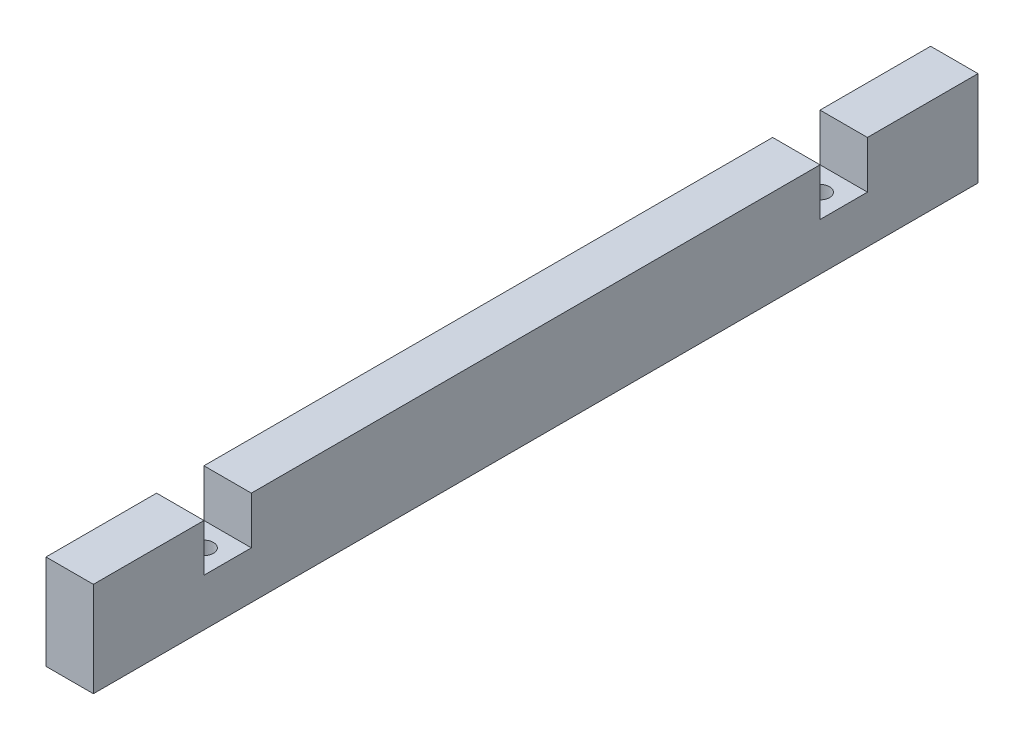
ISO-10303-21;
HEADER;
FILE_DESCRIPTION(('STEP AP214'),'2;1');
FILE_NAME('part.step','',(''),(''),'','','');
FILE_SCHEMA(('AUTOMOTIVE_DESIGN { 1 0 10303 214 1 1 1 1 }'));
ENDSEC;
DATA;
#1=APPLICATION_CONTEXT('core data for automotive mechanical design processes');
#2=APPLICATION_PROTOCOL_DEFINITION('international standard','automotive_design',2000,#1);
#3=PRODUCT_CONTEXT('',#1,'mechanical');
#4=PRODUCT('Part','Part','',(#3));
#5=PRODUCT_RELATED_PRODUCT_CATEGORY('part','',(#4));
#6=PRODUCT_DEFINITION_FORMATION('','',#4);
#7=PRODUCT_DEFINITION_CONTEXT('part definition',#1,'design');
#8=PRODUCT_DEFINITION('design','',#6,#7);
#9=PRODUCT_DEFINITION_SHAPE('','',#8);
#10=(LENGTH_UNIT() NAMED_UNIT(*) SI_UNIT(.MILLI.,.METRE.));
#11=(NAMED_UNIT(*) PLANE_ANGLE_UNIT() SI_UNIT($,.RADIAN.));
#12=(NAMED_UNIT(*) SI_UNIT($,.STERADIAN.) SOLID_ANGLE_UNIT());
#13=UNCERTAINTY_MEASURE_WITH_UNIT(LENGTH_MEASURE(1.E-05),#10,'distance_accuracy_value','');
#14=(GEOMETRIC_REPRESENTATION_CONTEXT(3) GLOBAL_UNCERTAINTY_ASSIGNED_CONTEXT((#13)) GLOBAL_UNIT_ASSIGNED_CONTEXT((#10,
#11,#12)) REPRESENTATION_CONTEXT('',''));
#15=CARTESIAN_POINT('',(0.,0.,0.));
#16=DIRECTION('',(0.,0.,1.));
#17=DIRECTION('',(1.,0.,0.));
#18=AXIS2_PLACEMENT_3D('',#15,#16,#17);
#19=CARTESIAN_POINT('',(0.,0.,140.));
#20=DIRECTION('',(0.,1.,0.));
#21=DIRECTION('',(-1.,0.,0.));
#22=AXIS2_PLACEMENT_3D('',#19,#20,#21);
#23=PLANE('',#22);
#24=DIRECTION('',(1.,0.,0.));
#25=VECTOR('',#24,1.);
#26=CARTESIAN_POINT('',(0.,0.,-140.));
#27=LINE('',#26,#25);
#28=CARTESIAN_POINT('',(-15.,0.,-140.));
#29=VERTEX_POINT('',#28);
#30=CARTESIAN_POINT('',(0.,0.,-140.));
#31=VERTEX_POINT('',#30);
#32=EDGE_CURVE('E202',#29,#31,#27,.T.);
#33=ORIENTED_EDGE('',*,*,#32,.T.);
#34=DIRECTION('',(0.,0.,-1.));
#35=VECTOR('',#34,1.);
#36=CARTESIAN_POINT('',(0.,0.,140.));
#37=LINE('',#36,#35);
#38=CARTESIAN_POINT('',(0.,0.,140.));
#39=VERTEX_POINT('',#38);
#40=EDGE_CURVE('E208',#39,#31,#37,.T.);
#41=ORIENTED_EDGE('',*,*,#40,.F.);
#42=DIRECTION('',(1.,0.,0.));
#43=VECTOR('',#42,1.);
#44=CARTESIAN_POINT('',(0.,0.,140.));
#45=LINE('',#44,#43);
#46=CARTESIAN_POINT('',(-15.,0.,140.));
#47=VERTEX_POINT('',#46);
#48=EDGE_CURVE('E206',#47,#39,#45,.T.);
#49=ORIENTED_EDGE('',*,*,#48,.F.);
#50=DIRECTION('',(0.,0.,-1.));
#51=VECTOR('',#50,1.);
#52=CARTESIAN_POINT('',(-15.,0.,140.));
#53=LINE('',#52,#51);
#54=EDGE_CURVE('E219',#47,#29,#53,.T.);
#55=ORIENTED_EDGE('',*,*,#54,.T.);
#56=EDGE_LOOP('',(#33,#41,#49,#55));
#57=FACE_BOUND('',#56,.T.);
#58=CARTESIAN_POINT('',(-7.5,0.,-97.5));
#59=DIRECTION('',(0.,1.,0.));
#60=DIRECTION('',(0.,0.,1.));
#61=AXIS2_PLACEMENT_3D('',#58,#59,#60);
#62=CIRCLE('',#61,3.);
#63=CARTESIAN_POINT('',(-7.5,0.,-94.5));
#64=VERTEX_POINT('',#63);
#65=EDGE_CURVE('E167',#64,#64,#62,.T.);
#66=ORIENTED_EDGE('',*,*,#65,.T.);
#67=EDGE_LOOP('',(#66));
#68=FACE_BOUND('',#67,.T.);
#69=CARTESIAN_POINT('',(-7.5,0.,97.5));
#70=DIRECTION('',(0.,-1.,0.));
#71=DIRECTION('',(0.,0.,-1.));
#72=AXIS2_PLACEMENT_3D('',#69,#70,#71);
#73=CIRCLE('',#72,3.);
#74=CARTESIAN_POINT('',(-7.5,0.,94.5));
#75=VERTEX_POINT('',#74);
#76=EDGE_CURVE('E158',#75,#75,#73,.T.);
#77=ORIENTED_EDGE('',*,*,#76,.F.);
#78=EDGE_LOOP('',(#77));
#79=FACE_BOUND('',#78,.T.);
#80=ADVANCED_FACE('F35',(#57,#68,#79),#23,.F.);
#81=CARTESIAN_POINT('',(-15.,15.,105.));
#82=DIRECTION('',(0.,1.,0.));
#83=DIRECTION('',(0.,0.,1.));
#84=AXIS2_PLACEMENT_3D('',#81,#82,#83);
#85=PLANE('',#84);
#86=DIRECTION('',(0.,0.,1.));
#87=VECTOR('',#86,1.);
#88=CARTESIAN_POINT('',(0.,15.,105.));
#89=LINE('',#88,#87);
#90=CARTESIAN_POINT('',(0.,15.,90.));
#91=VERTEX_POINT('',#90);
#92=CARTESIAN_POINT('',(0.,15.,105.));
#93=VERTEX_POINT('',#92);
#94=EDGE_CURVE('E150',#91,#93,#89,.T.);
#95=ORIENTED_EDGE('',*,*,#94,.F.);
#96=DIRECTION('',(1.,0.,0.));
#97=VECTOR('',#96,1.);
#98=CARTESIAN_POINT('',(-15.,15.,90.));
#99=LINE('',#98,#97);
#100=CARTESIAN_POINT('',(-15.,15.,90.));
#101=VERTEX_POINT('',#100);
#102=EDGE_CURVE('E51',#101,#91,#99,.T.);
#103=ORIENTED_EDGE('',*,*,#102,.F.);
#104=DIRECTION('',(0.,0.,1.));
#105=VECTOR('',#104,1.);
#106=CARTESIAN_POINT('',(-15.,15.,105.));
#107=LINE('',#106,#105);
#108=CARTESIAN_POINT('',(-15.,15.,105.));
#109=VERTEX_POINT('',#108);
#110=EDGE_CURVE('E123',#101,#109,#107,.T.);
#111=ORIENTED_EDGE('',*,*,#110,.T.);
#112=DIRECTION('',(1.,0.,0.));
#113=VECTOR('',#112,1.);
#114=CARTESIAN_POINT('',(-15.,15.,105.));
#115=LINE('',#114,#113);
#116=EDGE_CURVE('E127',#109,#93,#115,.T.);
#117=ORIENTED_EDGE('',*,*,#116,.T.);
#118=EDGE_LOOP('',(#95,#103,#111,#117));
#119=FACE_BOUND('',#118,.T.);
#120=CARTESIAN_POINT('',(-7.5,15.,97.5));
#121=DIRECTION('',(0.,-1.,0.));
#122=DIRECTION('',(0.,0.,-1.));
#123=AXIS2_PLACEMENT_3D('',#120,#121,#122);
#124=CIRCLE('',#123,3.);
#125=CARTESIAN_POINT('',(-7.5,15.,94.5));
#126=VERTEX_POINT('',#125);
#127=EDGE_CURVE('E153',#126,#126,#124,.T.);
#128=ORIENTED_EDGE('',*,*,#127,.T.);
#129=EDGE_LOOP('',(#128));
#130=FACE_BOUND('',#129,.T.);
#131=ADVANCED_FACE('F125',(#119,#130),#85,.T.);
#132=CARTESIAN_POINT('',(0.,0.,140.));
#133=DIRECTION('',(-1.,0.,0.));
#134=DIRECTION('',(0.,0.,1.));
#135=AXIS2_PLACEMENT_3D('',#132,#133,#134);
#136=PLANE('',#135);
#137=DIRECTION('',(0.,1.,0.));
#138=VECTOR('',#137,1.);
#139=CARTESIAN_POINT('',(0.,30.,105.));
#140=LINE('',#139,#138);
#141=CARTESIAN_POINT('',(0.,30.,105.));
#142=VERTEX_POINT('',#141);
#143=EDGE_CURVE('E139',#93,#142,#140,.T.);
#144=ORIENTED_EDGE('',*,*,#143,.T.);
#145=DIRECTION('',(0.,0.,-1.));
#146=VECTOR('',#145,1.);
#147=CARTESIAN_POINT('',(0.,30.,140.));
#148=LINE('',#147,#146);
#149=CARTESIAN_POINT('',(0.,30.,140.));
#150=VERTEX_POINT('',#149);
#151=EDGE_CURVE('E11',#150,#142,#148,.T.);
#152=ORIENTED_EDGE('',*,*,#151,.F.);
#153=DIRECTION('',(0.,1.,0.));
#154=VECTOR('',#153,1.);
#155=CARTESIAN_POINT('',(0.,0.,140.));
#156=LINE('',#155,#154);
#157=EDGE_CURVE('E198',#39,#150,#156,.T.);
#158=ORIENTED_EDGE('',*,*,#157,.F.);
#159=ORIENTED_EDGE('',*,*,#40,.T.);
#160=DIRECTION('',(0.,1.,0.));
#161=VECTOR('',#160,1.);
#162=CARTESIAN_POINT('',(0.,0.,-140.));
#163=LINE('',#162,#161);
#164=CARTESIAN_POINT('',(0.,30.,-140.));
#165=VERTEX_POINT('',#164);
#166=EDGE_CURVE('E190',#31,#165,#163,.T.);
#167=ORIENTED_EDGE('',*,*,#166,.T.);
#168=CARTESIAN_POINT('',(0.,30.,-105.));
#169=VERTEX_POINT('',#168);
#170=EDGE_CURVE('E44',#169,#165,#148,.T.);
#171=ORIENTED_EDGE('',*,*,#170,.F.);
#172=DIRECTION('',(0.,1.,0.));
#173=VECTOR('',#172,1.);
#174=CARTESIAN_POINT('',(0.,30.,-105.));
#175=LINE('',#174,#173);
#176=CARTESIAN_POINT('',(0.,15.,-105.));
#177=VERTEX_POINT('',#176);
#178=EDGE_CURVE('E170',#177,#169,#175,.T.);
#179=ORIENTED_EDGE('',*,*,#178,.F.);
#180=DIRECTION('',(0.,0.,-1.));
#181=VECTOR('',#180,1.);
#182=CARTESIAN_POINT('',(0.,15.,-105.));
#183=LINE('',#182,#181);
#184=CARTESIAN_POINT('',(0.,15.,-90.));
#185=VERTEX_POINT('',#184);
#186=EDGE_CURVE('E177',#185,#177,#183,.T.);
#187=ORIENTED_EDGE('',*,*,#186,.F.);
#188=DIRECTION('',(0.,-1.,0.));
#189=VECTOR('',#188,1.);
#190=CARTESIAN_POINT('',(0.,30.,-90.));
#191=LINE('',#190,#189);
#192=CARTESIAN_POINT('',(0.,30.,-90.));
#193=VERTEX_POINT('',#192);
#194=EDGE_CURVE('E183',#193,#185,#191,.T.);
#195=ORIENTED_EDGE('',*,*,#194,.F.);
#196=CARTESIAN_POINT('',(0.,30.,90.));
#197=VERTEX_POINT('',#196);
#198=EDGE_CURVE('E43',#197,#193,#148,.T.);
#199=ORIENTED_EDGE('',*,*,#198,.F.);
#200=DIRECTION('',(0.,-1.,0.));
#201=VECTOR('',#200,1.);
#202=CARTESIAN_POINT('',(0.,30.,90.));
#203=LINE('',#202,#201);
#204=EDGE_CURVE('E147',#197,#91,#203,.T.);
#205=ORIENTED_EDGE('',*,*,#204,.T.);
#206=ORIENTED_EDGE('',*,*,#94,.T.);
#207=EDGE_LOOP('',(#144,#152,#158,#159,#167,#171,#179,#187,#195,#199,#205,#206));
#208=FACE_BOUND('',#207,.T.);
#209=ADVANCED_FACE('F37',(#208),#136,.F.);
#210=CARTESIAN_POINT('',(0.,30.,140.));
#211=DIRECTION('',(0.,-1.,0.));
#212=DIRECTION('',(1.,0.,0.));
#213=AXIS2_PLACEMENT_3D('',#210,#211,#212);
#214=PLANE('',#213);
#215=DIRECTION('',(1.,0.,0.));
#216=VECTOR('',#215,1.);
#217=CARTESIAN_POINT('',(-15.,30.,105.));
#218=LINE('',#217,#216);
#219=CARTESIAN_POINT('',(-15.,30.,105.));
#220=VERTEX_POINT('',#219);
#221=EDGE_CURVE('E160',#220,#142,#218,.T.);
#222=ORIENTED_EDGE('',*,*,#221,.F.);
#223=DIRECTION('',(0.,0.,-1.));
#224=VECTOR('',#223,1.);
#225=CARTESIAN_POINT('',(-15.,30.,140.));
#226=LINE('',#225,#224);
#227=CARTESIAN_POINT('',(-15.,30.,140.));
#228=VERTEX_POINT('',#227);
#229=EDGE_CURVE('E146',#228,#220,#226,.T.);
#230=ORIENTED_EDGE('',*,*,#229,.F.);
#231=DIRECTION('',(-1.,0.,0.));
#232=VECTOR('',#231,1.);
#233=CARTESIAN_POINT('',(0.,30.,140.));
#234=LINE('',#233,#232);
#235=EDGE_CURVE('E201',#150,#228,#234,.T.);
#236=ORIENTED_EDGE('',*,*,#235,.F.);
#237=ORIENTED_EDGE('',*,*,#151,.T.);
#238=EDGE_LOOP('',(#222,#230,#236,#237));
#239=FACE_BOUND('',#238,.T.);
#240=ADVANCED_FACE('F245',(#239),#214,.F.);
#241=DIRECTION('',(1.,0.,0.));
#242=VECTOR('',#241,1.);
#243=CARTESIAN_POINT('',(-15.,30.,90.));
#244=LINE('',#243,#242);
#245=CARTESIAN_POINT('',(-15.,30.,90.));
#246=VERTEX_POINT('',#245);
#247=EDGE_CURVE('E163',#246,#197,#244,.T.);
#248=ORIENTED_EDGE('',*,*,#247,.T.);
#249=ORIENTED_EDGE('',*,*,#198,.T.);
#250=DIRECTION('',(1.,0.,0.));
#251=VECTOR('',#250,1.);
#252=CARTESIAN_POINT('',(-15.,30.,-90.));
#253=LINE('',#252,#251);
#254=CARTESIAN_POINT('',(-15.,30.,-90.));
#255=VERTEX_POINT('',#254);
#256=EDGE_CURVE('E193',#255,#193,#253,.T.);
#257=ORIENTED_EDGE('',*,*,#256,.F.);
#258=EDGE_CURVE('E222',#246,#255,#226,.T.);
#259=ORIENTED_EDGE('',*,*,#258,.F.);
#260=EDGE_LOOP('',(#248,#249,#257,#259));
#261=FACE_BOUND('',#260,.T.);
#262=ADVANCED_FACE('F252',(#261),#214,.F.);
#263=CARTESIAN_POINT('',(-15.,0.,140.));
#264=DIRECTION('',(1.,0.,0.));
#265=DIRECTION('',(0.,1.,0.));
#266=AXIS2_PLACEMENT_3D('',#263,#264,#265);
#267=PLANE('',#266);
#268=DIRECTION('',(0.,1.,0.));
#269=VECTOR('',#268,1.);
#270=CARTESIAN_POINT('',(-15.,30.,105.));
#271=LINE('',#270,#269);
#272=EDGE_CURVE('E133',#109,#220,#271,.T.);
#273=ORIENTED_EDGE('',*,*,#272,.F.);
#274=ORIENTED_EDGE('',*,*,#110,.F.);
#275=DIRECTION('',(0.,-1.,0.));
#276=VECTOR('',#275,1.);
#277=CARTESIAN_POINT('',(-15.,30.,90.));
#278=LINE('',#277,#276);
#279=EDGE_CURVE('E132',#246,#101,#278,.T.);
#280=ORIENTED_EDGE('',*,*,#279,.F.);
#281=ORIENTED_EDGE('',*,*,#258,.T.);
#282=DIRECTION('',(0.,-1.,0.));
#283=VECTOR('',#282,1.);
#284=CARTESIAN_POINT('',(-15.,30.,-90.));
#285=LINE('',#284,#283);
#286=CARTESIAN_POINT('',(-15.,15.,-90.));
#287=VERTEX_POINT('',#286);
#288=EDGE_CURVE('E176',#255,#287,#285,.T.);
#289=ORIENTED_EDGE('',*,*,#288,.T.);
#290=DIRECTION('',(0.,0.,-1.));
#291=VECTOR('',#290,1.);
#292=CARTESIAN_POINT('',(-15.,15.,-105.));
#293=LINE('',#292,#291);
#294=CARTESIAN_POINT('',(-15.,15.,-105.));
#295=VERTEX_POINT('',#294);
#296=EDGE_CURVE('E59',#287,#295,#293,.T.);
#297=ORIENTED_EDGE('',*,*,#296,.T.);
#298=DIRECTION('',(0.,1.,0.));
#299=VECTOR('',#298,1.);
#300=CARTESIAN_POINT('',(-15.,30.,-105.));
#301=LINE('',#300,#299);
#302=CARTESIAN_POINT('',(-15.,30.,-105.));
#303=VERTEX_POINT('',#302);
#304=EDGE_CURVE('E173',#295,#303,#301,.T.);
#305=ORIENTED_EDGE('',*,*,#304,.T.);
#306=CARTESIAN_POINT('',(-15.,30.,-140.));
#307=VERTEX_POINT('',#306);
#308=EDGE_CURVE('E221',#303,#307,#226,.T.);
#309=ORIENTED_EDGE('',*,*,#308,.T.);
#310=DIRECTION('',(0.,-1.,0.));
#311=VECTOR('',#310,1.);
#312=CARTESIAN_POINT('',(-15.,0.,-140.));
#313=LINE('',#312,#311);
#314=EDGE_CURVE('E214',#307,#29,#313,.T.);
#315=ORIENTED_EDGE('',*,*,#314,.T.);
#316=ORIENTED_EDGE('',*,*,#54,.F.);
#317=DIRECTION('',(0.,-1.,0.));
#318=VECTOR('',#317,1.);
#319=CARTESIAN_POINT('',(-15.,0.,140.));
#320=LINE('',#319,#318);
#321=EDGE_CURVE('E204',#228,#47,#320,.T.);
#322=ORIENTED_EDGE('',*,*,#321,.F.);
#323=ORIENTED_EDGE('',*,*,#229,.T.);
#324=EDGE_LOOP('',(#273,#274,#280,#281,#289,#297,#305,#309,#315,#316,#322,#323));
#325=FACE_BOUND('',#324,.T.);
#326=ADVANCED_FACE('F143',(#325),#267,.F.);
#327=ORIENTED_EDGE('',*,*,#308,.F.);
#328=DIRECTION('',(1.,0.,0.));
#329=VECTOR('',#328,1.);
#330=CARTESIAN_POINT('',(-15.,30.,-105.));
#331=LINE('',#330,#329);
#332=EDGE_CURVE('E181',#303,#169,#331,.T.);
#333=ORIENTED_EDGE('',*,*,#332,.T.);
#334=ORIENTED_EDGE('',*,*,#170,.T.);
#335=DIRECTION('',(-1.,0.,0.));
#336=VECTOR('',#335,1.);
#337=CARTESIAN_POINT('',(0.,30.,-140.));
#338=LINE('',#337,#336);
#339=EDGE_CURVE('E211',#165,#307,#338,.T.);
#340=ORIENTED_EDGE('',*,*,#339,.T.);
#341=EDGE_LOOP('',(#327,#333,#334,#340));
#342=FACE_BOUND('',#341,.T.);
#343=ADVANCED_FACE('F229',(#342),#214,.F.);
#344=CARTESIAN_POINT('',(0.,30.,140.));
#345=DIRECTION('',(0.,0.,1.));
#346=DIRECTION('',(1.,0.,0.));
#347=AXIS2_PLACEMENT_3D('',#344,#345,#346);
#348=PLANE('',#347);
#349=ORIENTED_EDGE('',*,*,#157,.T.);
#350=ORIENTED_EDGE('',*,*,#235,.T.);
#351=ORIENTED_EDGE('',*,*,#321,.T.);
#352=ORIENTED_EDGE('',*,*,#48,.T.);
#353=EDGE_LOOP('',(#349,#350,#351,#352));
#354=FACE_BOUND('',#353,.T.);
#355=ADVANCED_FACE('F243',(#354),#348,.T.);
#356=CARTESIAN_POINT('',(0.,30.,-140.));
#357=DIRECTION('',(0.,0.,1.));
#358=DIRECTION('',(1.,0.,0.));
#359=AXIS2_PLACEMENT_3D('',#356,#357,#358);
#360=PLANE('',#359);
#361=ORIENTED_EDGE('',*,*,#166,.F.);
#362=ORIENTED_EDGE('',*,*,#32,.F.);
#363=ORIENTED_EDGE('',*,*,#314,.F.);
#364=ORIENTED_EDGE('',*,*,#339,.F.);
#365=EDGE_LOOP('',(#361,#362,#363,#364));
#366=FACE_BOUND('',#365,.T.);
#367=ADVANCED_FACE('F234',(#366),#360,.F.);
#368=CARTESIAN_POINT('',(-15.,30.,-105.));
#369=DIRECTION('',(0.,0.,-1.));
#370=DIRECTION('',(-1.,0.,0.));
#371=AXIS2_PLACEMENT_3D('',#368,#369,#370);
#372=PLANE('',#371);
#373=ORIENTED_EDGE('',*,*,#178,.T.);
#374=ORIENTED_EDGE('',*,*,#332,.F.);
#375=ORIENTED_EDGE('',*,*,#304,.F.);
#376=DIRECTION('',(1.,0.,0.));
#377=VECTOR('',#376,1.);
#378=CARTESIAN_POINT('',(-15.,15.,-105.));
#379=LINE('',#378,#377);
#380=EDGE_CURVE('E188',#295,#177,#379,.T.);
#381=ORIENTED_EDGE('',*,*,#380,.T.);
#382=EDGE_LOOP('',(#373,#374,#375,#381));
#383=FACE_BOUND('',#382,.T.);
#384=ADVANCED_FACE('F261',(#383),#372,.F.);
#385=CARTESIAN_POINT('',(-15.,15.,-105.));
#386=DIRECTION('',(0.,-1.,0.));
#387=DIRECTION('',(0.,0.,-1.));
#388=AXIS2_PLACEMENT_3D('',#385,#386,#387);
#389=PLANE('',#388);
#390=CARTESIAN_POINT('',(-7.5,15.,-97.5));
#391=DIRECTION('',(0.,1.,0.));
#392=DIRECTION('',(0.,0.,1.));
#393=AXIS2_PLACEMENT_3D('',#390,#391,#392);
#394=CIRCLE('',#393,3.);
#395=CARTESIAN_POINT('',(-7.5,15.,-94.5));
#396=VERTEX_POINT('',#395);
#397=EDGE_CURVE('E162',#396,#396,#394,.T.);
#398=ORIENTED_EDGE('',*,*,#397,.F.);
#399=EDGE_LOOP('',(#398));
#400=FACE_BOUND('',#399,.T.);
#401=ORIENTED_EDGE('',*,*,#186,.T.);
#402=ORIENTED_EDGE('',*,*,#380,.F.);
#403=ORIENTED_EDGE('',*,*,#296,.F.);
#404=DIRECTION('',(1.,0.,0.));
#405=VECTOR('',#404,1.);
#406=CARTESIAN_POINT('',(-15.,15.,-90.));
#407=LINE('',#406,#405);
#408=EDGE_CURVE('E191',#287,#185,#407,.T.);
#409=ORIENTED_EDGE('',*,*,#408,.T.);
#410=EDGE_LOOP('',(#401,#402,#403,#409));
#411=FACE_BOUND('',#410,.T.);
#412=ADVANCED_FACE('F258',(#400,#411),#389,.F.);
#413=CARTESIAN_POINT('',(-15.,30.,-90.));
#414=DIRECTION('',(0.,0.,1.));
#415=DIRECTION('',(1.,0.,0.));
#416=AXIS2_PLACEMENT_3D('',#413,#414,#415);
#417=PLANE('',#416);
#418=ORIENTED_EDGE('',*,*,#194,.T.);
#419=ORIENTED_EDGE('',*,*,#408,.F.);
#420=ORIENTED_EDGE('',*,*,#288,.F.);
#421=ORIENTED_EDGE('',*,*,#256,.T.);
#422=EDGE_LOOP('',(#418,#419,#420,#421));
#423=FACE_BOUND('',#422,.T.);
#424=ADVANCED_FACE('F256',(#423),#417,.F.);
#425=CARTESIAN_POINT('',(-7.5,0.,-97.5));
#426=DIRECTION('',(0.,1.,0.));
#427=DIRECTION('',(0.,0.,1.));
#428=AXIS2_PLACEMENT_3D('',#425,#426,#427);
#429=CYLINDRICAL_SURFACE('',#428,3.);
#430=CARTESIAN_POINT('',(-7.5,0.,-94.5));
#431=CARTESIAN_POINT('',(-7.5,0.156249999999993,-94.5));
#432=CARTESIAN_POINT('',(-7.5,0.312499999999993,-94.5));
#433=CARTESIAN_POINT('',(-7.5,0.624999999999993,-94.5));
#434=CARTESIAN_POINT('',(-7.5,0.781249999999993,-94.5));
#435=CARTESIAN_POINT('',(-7.5,1.09374999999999,-94.5));
#436=CARTESIAN_POINT('',(-7.5,1.24999999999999,-94.5));
#437=CARTESIAN_POINT('',(-7.5,1.56249999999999,-94.5));
#438=CARTESIAN_POINT('',(-7.5,1.71874999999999,-94.5));
#439=CARTESIAN_POINT('',(-7.5,2.03124999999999,-94.5));
#440=CARTESIAN_POINT('',(-7.5,2.18749999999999,-94.5));
#441=CARTESIAN_POINT('',(-7.5,2.49999999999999,-94.5));
#442=CARTESIAN_POINT('',(-7.5,2.65624999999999,-94.5));
#443=CARTESIAN_POINT('',(-7.5,2.96874999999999,-94.5));
#444=CARTESIAN_POINT('',(-7.5,3.12499999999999,-94.5));
#445=CARTESIAN_POINT('',(-7.5,3.43749999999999,-94.5));
#446=CARTESIAN_POINT('',(-7.5,3.59374999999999,-94.5));
#447=CARTESIAN_POINT('',(-7.5,3.90624999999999,-94.5));
#448=CARTESIAN_POINT('',(-7.5,4.06249999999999,-94.5));
#449=CARTESIAN_POINT('',(-7.5,4.37499999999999,-94.5));
#450=CARTESIAN_POINT('',(-7.5,4.53124999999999,-94.5));
#451=CARTESIAN_POINT('',(-7.5,4.84374999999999,-94.5));
#452=CARTESIAN_POINT('',(-7.5,4.99999999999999,-94.5));
#453=CARTESIAN_POINT('',(-7.5,5.31249999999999,-94.5));
#454=CARTESIAN_POINT('',(-7.5,5.46874999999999,-94.5));
#455=CARTESIAN_POINT('',(-7.5,5.78124999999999,-94.5));
#456=CARTESIAN_POINT('',(-7.5,5.93749999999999,-94.5));
#457=CARTESIAN_POINT('',(-7.5,6.24999999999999,-94.5));
#458=CARTESIAN_POINT('',(-7.5,6.40624999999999,-94.5));
#459=CARTESIAN_POINT('',(-7.5,6.71874999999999,-94.5));
#460=CARTESIAN_POINT('',(-7.5,6.87499999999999,-94.5));
#461=CARTESIAN_POINT('',(-7.5,7.18749999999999,-94.5));
#462=CARTESIAN_POINT('',(-7.5,7.34374999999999,-94.5));
#463=CARTESIAN_POINT('',(-7.5,7.65624999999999,-94.5));
#464=CARTESIAN_POINT('',(-7.5,7.81249999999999,-94.5));
#465=CARTESIAN_POINT('',(-7.5,8.12499999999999,-94.5));
#466=CARTESIAN_POINT('',(-7.5,8.28124999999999,-94.5));
#467=CARTESIAN_POINT('',(-7.5,8.59374999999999,-94.5));
#468=CARTESIAN_POINT('',(-7.5,8.74999999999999,-94.5));
#469=CARTESIAN_POINT('',(-7.5,9.06249999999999,-94.5));
#470=CARTESIAN_POINT('',(-7.5,9.21874999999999,-94.5));
#471=CARTESIAN_POINT('',(-7.5,9.53124999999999,-94.5));
#472=CARTESIAN_POINT('',(-7.5,9.68749999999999,-94.5));
#473=CARTESIAN_POINT('',(-7.5,9.99999999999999,-94.5));
#474=CARTESIAN_POINT('',(-7.5,10.15625,-94.5));
#475=CARTESIAN_POINT('',(-7.5,10.46875,-94.5));
#476=CARTESIAN_POINT('',(-7.5,10.625,-94.5));
#477=CARTESIAN_POINT('',(-7.5,10.9375,-94.5));
#478=CARTESIAN_POINT('',(-7.5,11.09375,-94.5));
#479=CARTESIAN_POINT('',(-7.5,11.40625,-94.5));
#480=CARTESIAN_POINT('',(-7.5,11.5625,-94.5));
#481=CARTESIAN_POINT('',(-7.5,11.875,-94.5));
#482=CARTESIAN_POINT('',(-7.5,12.03125,-94.5));
#483=CARTESIAN_POINT('',(-7.5,12.34375,-94.5));
#484=CARTESIAN_POINT('',(-7.5,12.5,-94.5));
#485=CARTESIAN_POINT('',(-7.5,12.8125,-94.5));
#486=CARTESIAN_POINT('',(-7.5,12.96875,-94.5));
#487=CARTESIAN_POINT('',(-7.5,13.28125,-94.5));
#488=CARTESIAN_POINT('',(-7.5,13.4375,-94.5));
#489=CARTESIAN_POINT('',(-7.5,13.75,-94.5));
#490=CARTESIAN_POINT('',(-7.5,13.90625,-94.5));
#491=CARTESIAN_POINT('',(-7.5,14.21875,-94.5));
#492=CARTESIAN_POINT('',(-7.5,14.375,-94.5));
#493=CARTESIAN_POINT('',(-7.5,14.6875,-94.5));
#494=CARTESIAN_POINT('',(-7.5,14.84375,-94.5));
#495=CARTESIAN_POINT('',(-7.5,15.,-94.5));
#496=B_SPLINE_CURVE_WITH_KNOTS('',3,(#430,#431,#432,#433,#434,#435,#436,#437,#438,#439,#440,
#441,#442,#443,#444,#445,#446,#447,#448,#449,#450,#451,#452,#453,#454,#455,#456,#457,#458,#459,
#460,#461,#462,#463,#464,#465,#466,#467,#468,#469,#470,#471,#472,#473,#474,#475,#476,#477,#478,
#479,#480,#481,#482,#483,#484,#485,#486,#487,#488,#489,#490,#491,#492,#493,#494,#495),
.UNSPECIFIED.,.F.,.F.,(4,2,2,2,2,2,2,2,2,2,2,2,2,2,2,2,2,2,2,2,2,2,2,2,2,2,2,2,2,2,2,2,4),(0.,
0.46875,0.9375,1.40625,1.875,2.34375,2.8125,3.28125,3.75,4.21875,4.6875,5.15625,5.625,6.09375,
6.5625,7.03125,7.5,7.96875,8.4375,8.90625,9.375,9.84375,10.3125,10.78125,11.25,11.71875,12.1875,
12.65625,13.125,13.59375,14.0625,14.53125,15.),.UNSPECIFIED.);
#497=EDGE_CURVE('BSEAM314',#64,#396,#496,.T.);
#498=ORIENTED_EDGE('',*,*,#65,.F.);
#499=ORIENTED_EDGE('',*,*,#397,.T.);
#500=ORIENTED_EDGE('',*,*,#497,.T.);
#501=ORIENTED_EDGE('',*,*,#497,.F.);
#502=EDGE_LOOP('',(#498,#500,#499,#501));
#503=FACE_BOUND('',#502,.T.);
#504=ADVANCED_FACE('F314',(#503),#429,.F.);
#505=CARTESIAN_POINT('',(-15.,30.,105.));
#506=DIRECTION('',(0.,0.,-1.));
#507=DIRECTION('',(-1.,0.,0.));
#508=AXIS2_PLACEMENT_3D('',#505,#506,#507);
#509=PLANE('',#508);
#510=ORIENTED_EDGE('',*,*,#143,.F.);
#511=ORIENTED_EDGE('',*,*,#116,.F.);
#512=ORIENTED_EDGE('',*,*,#272,.T.);
#513=ORIENTED_EDGE('',*,*,#221,.T.);
#514=EDGE_LOOP('',(#510,#511,#512,#513));
#515=FACE_BOUND('',#514,.T.);
#516=ADVANCED_FACE('F136',(#515),#509,.T.);
#517=CARTESIAN_POINT('',(-15.,30.,90.));
#518=DIRECTION('',(0.,0.,1.));
#519=DIRECTION('',(1.,0.,0.));
#520=AXIS2_PLACEMENT_3D('',#517,#518,#519);
#521=PLANE('',#520);
#522=ORIENTED_EDGE('',*,*,#204,.F.);
#523=ORIENTED_EDGE('',*,*,#247,.F.);
#524=ORIENTED_EDGE('',*,*,#279,.T.);
#525=ORIENTED_EDGE('',*,*,#102,.T.);
#526=EDGE_LOOP('',(#522,#523,#524,#525));
#527=FACE_BOUND('',#526,.T.);
#528=ADVANCED_FACE('F249',(#527),#521,.T.);
#529=CARTESIAN_POINT('',(-7.5,0.,97.5));
#530=DIRECTION('',(0.,1.,0.));
#531=DIRECTION('',(0.,0.,1.));
#532=AXIS2_PLACEMENT_3D('',#529,#530,#531);
#533=CYLINDRICAL_SURFACE('',#532,3.);
#534=ORIENTED_EDGE('',*,*,#76,.T.);
#535=EDGE_LOOP('',(#534));
#536=FACE_BOUND('',#535,.T.);
#537=ORIENTED_EDGE('',*,*,#127,.F.);
#538=EDGE_LOOP('',(#537));
#539=FACE_BOUND('',#538,.T.);
#540=ADVANCED_FACE('F377',(#536,#539),#533,.F.);
#541=CLOSED_SHELL('',(#80,#131,#209,#240,#262,#326,#343,#355,#367,#384,#412,#424,#504,#516,#528,#540));
#542=MANIFOLD_SOLID_BREP('B2',#541);
#543=ADVANCED_BREP_SHAPE_REPRESENTATION('',(#18,#542),#14);
#544=SHAPE_DEFINITION_REPRESENTATION(#9,#543);
ENDSEC;
END-ISO-10303-21;
